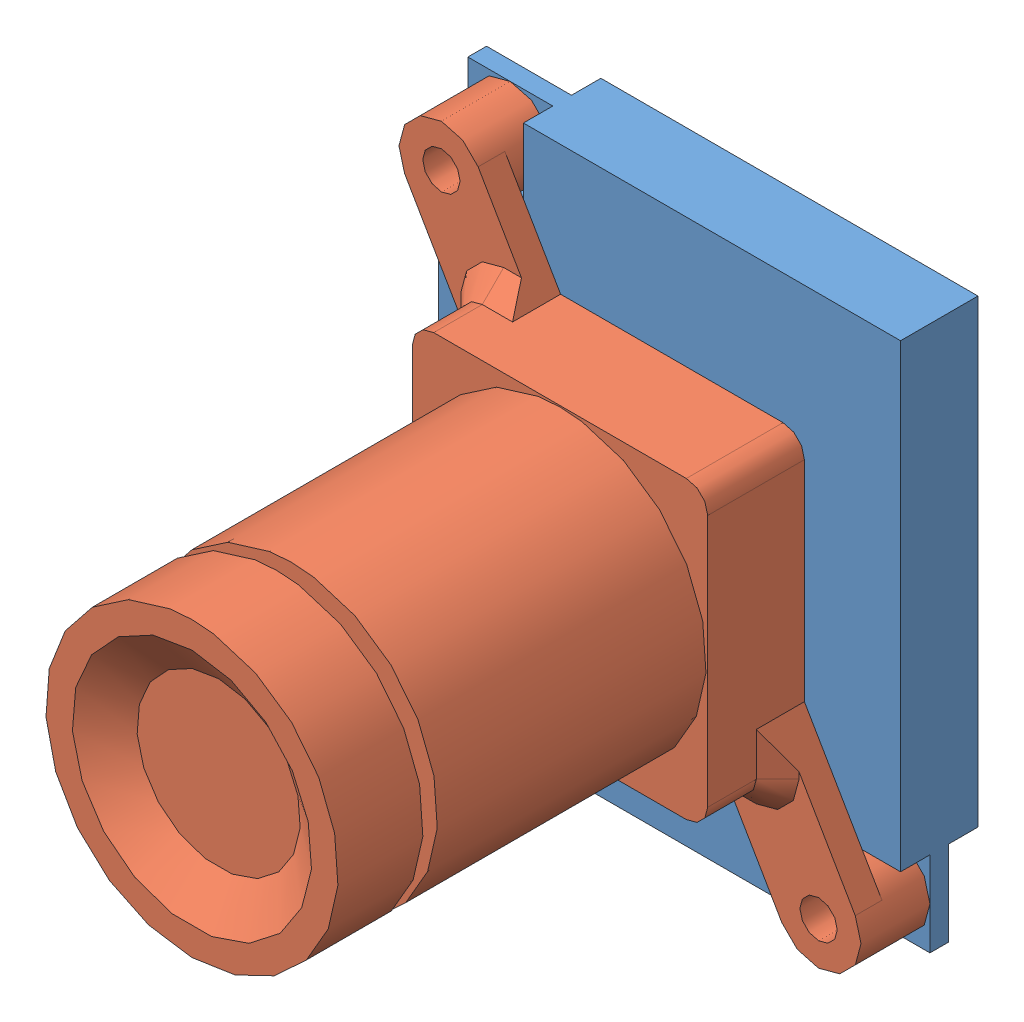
SolidWorks assembly small ccd assem.SLDASM, configuration Default (file format 3100). Lengths in mm.
Overall size (21.97 25.91 29.31).
2 component instances, 2 part files, 2 mates.
Components (placement in the parent):
- CCD back card-1: CCD back card.SLDPRT [Default] at (-63.2621 8.497 25.622) size (21.97 25.91 6.6)
- CCD-1: CCD.SLDPRT [Default] at (-74.2476 21.8241 33.115) x (0 0 1) z (0 -1 0) size (24.1 21.97 25.91)
Mates (geometry in assembly coordinates):
- Parallel2: parallel aligned: line of CCD back card-1; line of CCD-1
- Coincident3: coincident anti-aligned: circle of CCD back card-1 centre (-83.2138 32.3857 26.511) axis (0 0 1); circle of CCD-1 centre (-83.2138 32.3857 26.511) axis (0 0 -1)
